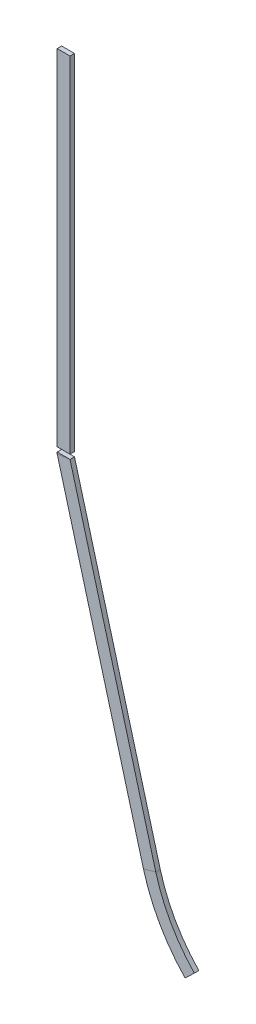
ISO-10303-21;
HEADER;
FILE_DESCRIPTION(('STEP AP214'),'2;1');
FILE_NAME('part.step','',(''),(''),'','','');
FILE_SCHEMA(('AUTOMOTIVE_DESIGN { 1 0 10303 214 1 1 1 1 }'));
ENDSEC;
DATA;
#1=APPLICATION_CONTEXT('core data for automotive mechanical design processes');
#2=APPLICATION_PROTOCOL_DEFINITION('international standard','automotive_design',2000,#1);
#3=PRODUCT_CONTEXT('',#1,'mechanical');
#4=PRODUCT('Part','Part','',(#3));
#5=PRODUCT_RELATED_PRODUCT_CATEGORY('part','',(#4));
#6=PRODUCT_DEFINITION_FORMATION('','',#4);
#7=PRODUCT_DEFINITION_CONTEXT('part definition',#1,'design');
#8=PRODUCT_DEFINITION('design','',#6,#7);
#9=PRODUCT_DEFINITION_SHAPE('','',#8);
#10=(LENGTH_UNIT() NAMED_UNIT(*) SI_UNIT(.MILLI.,.METRE.));
#11=(NAMED_UNIT(*) PLANE_ANGLE_UNIT() SI_UNIT($,.RADIAN.));
#12=(NAMED_UNIT(*) SI_UNIT($,.STERADIAN.) SOLID_ANGLE_UNIT());
#13=UNCERTAINTY_MEASURE_WITH_UNIT(LENGTH_MEASURE(1.E-05),#10,'distance_accuracy_value','');
#14=(GEOMETRIC_REPRESENTATION_CONTEXT(3) GLOBAL_UNCERTAINTY_ASSIGNED_CONTEXT((#13)) GLOBAL_UNIT_ASSIGNED_CONTEXT((#10,
#11,#12)) REPRESENTATION_CONTEXT('',''));
#15=CARTESIAN_POINT('',(0.,0.,0.));
#16=DIRECTION('',(0.,0.,1.));
#17=DIRECTION('',(1.,0.,0.));
#18=AXIS2_PLACEMENT_3D('',#15,#16,#17);
#19=CARTESIAN_POINT('',(-587.500000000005,2533.,-7.));
#20=DIRECTION('',(0.,0.,-1.));
#21=DIRECTION('',(-1.,0.,0.));
#22=AXIS2_PLACEMENT_3D('',#19,#20,#21);
#23=PLANE('',#22);
#24=DIRECTION('',(0.,-1.,0.));
#25=VECTOR('',#24,1.);
#26=CARTESIAN_POINT('',(-627.500000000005,2532.99999999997,-7.));
#27=LINE('',#26,#25);
#28=CARTESIAN_POINT('',(-627.500000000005,1443.,-7.));
#29=VERTEX_POINT('',#28);
#30=CARTESIAN_POINT('',(-627.500000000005,1437.64199433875,-7.));
#31=VERTEX_POINT('',#30);
#32=EDGE_CURVE('E111',#29,#31,#27,.T.);
#33=ORIENTED_EDGE('',*,*,#32,.F.);
#34=DIRECTION('',(-1.,0.,0.));
#35=VECTOR('',#34,1.);
#36=CARTESIAN_POINT('',(-587.500000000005,1443.,-7.));
#37=LINE('',#36,#35);
#38=CARTESIAN_POINT('',(-587.500000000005,1443.,-7.));
#39=VERTEX_POINT('',#38);
#40=EDGE_CURVE('E70',#39,#29,#37,.T.);
#41=ORIENTED_EDGE('',*,*,#40,.F.);
#42=DIRECTION('',(-0.991147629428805,-0.132764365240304,0.));
#43=VECTOR('',#42,1.);
#44=CARTESIAN_POINT('',(-444.067896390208,1462.21275057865,-6.99999999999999));
#45=LINE('',#44,#43);
#46=EDGE_CURVE('E117',#39,#31,#45,.T.);
#47=ORIENTED_EDGE('',*,*,#46,.T.);
#48=EDGE_LOOP('',(#33,#41,#47));
#49=FACE_BOUND('',#48,.T.);
#50=ADVANCED_FACE('F43',(#49),#23,.T.);
#51=CARTESIAN_POINT('',(-627.500000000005,2532.99999999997,-7.));
#52=DIRECTION('',(-1.,0.,0.));
#53=DIRECTION('',(0.,-1.,0.));
#54=AXIS2_PLACEMENT_3D('',#51,#52,#53);
#55=PLANE('',#54);
#56=DIRECTION('',(0.,-1.,0.));
#57=VECTOR('',#56,1.);
#58=CARTESIAN_POINT('',(-627.500000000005,2532.99999999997,7.));
#59=LINE('',#58,#57);
#60=CARTESIAN_POINT('',(-627.500000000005,1443.,7.));
#61=VERTEX_POINT('',#60);
#62=CARTESIAN_POINT('',(-627.500000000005,1437.64199433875,7.));
#63=VERTEX_POINT('',#62);
#64=EDGE_CURVE('E46',#61,#63,#59,.T.);
#65=ORIENTED_EDGE('',*,*,#64,.F.);
#66=DIRECTION('',(0.,0.,1.));
#67=VECTOR('',#66,1.);
#68=CARTESIAN_POINT('',(-627.500000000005,1443.,-49.3792402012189));
#69=LINE('',#68,#67);
#70=EDGE_CURVE('E51',#29,#61,#69,.T.);
#71=ORIENTED_EDGE('',*,*,#70,.F.);
#72=ORIENTED_EDGE('',*,*,#32,.T.);
#73=DIRECTION('',(0.,0.,1.));
#74=VECTOR('',#73,1.);
#75=CARTESIAN_POINT('',(-627.500000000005,1437.64199433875,-7.));
#76=LINE('',#75,#74);
#77=EDGE_CURVE('E114',#31,#63,#76,.T.);
#78=ORIENTED_EDGE('',*,*,#77,.T.);
#79=EDGE_LOOP('',(#65,#71,#72,#78));
#80=FACE_BOUND('',#79,.T.);
#81=ADVANCED_FACE('F113',(#80),#55,.T.);
#82=CARTESIAN_POINT('',(-587.500000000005,2533.,7.));
#83=DIRECTION('',(0.,0.,1.));
#84=DIRECTION('',(1.,0.,0.));
#85=AXIS2_PLACEMENT_3D('',#82,#83,#84);
#86=PLANE('',#85);
#87=DIRECTION('',(0.991147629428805,0.132764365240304,0.));
#88=VECTOR('',#87,1.);
#89=CARTESIAN_POINT('',(-444.067896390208,1462.21275057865,7.));
#90=LINE('',#89,#88);
#91=CARTESIAN_POINT('',(-587.500000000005,1443.,7.));
#92=VERTEX_POINT('',#91);
#93=EDGE_CURVE('E126',#63,#92,#90,.T.);
#94=ORIENTED_EDGE('',*,*,#93,.T.);
#95=DIRECTION('',(-1.,0.,0.));
#96=VECTOR('',#95,1.);
#97=CARTESIAN_POINT('',(-587.500000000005,1443.,7.));
#98=LINE('',#97,#96);
#99=EDGE_CURVE('E63',#92,#61,#98,.T.);
#100=ORIENTED_EDGE('',*,*,#99,.T.);
#101=ORIENTED_EDGE('',*,*,#64,.T.);
#102=EDGE_LOOP('',(#94,#100,#101));
#103=FACE_BOUND('',#102,.T.);
#104=ADVANCED_FACE('F189',(#103),#86,.T.);
#105=CARTESIAN_POINT('',(225.88270358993,653.858954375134,0.));
#106=DIRECTION('',(0.689407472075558,-0.724373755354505,0.));
#107=DIRECTION('',(0.724373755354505,0.689407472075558,0.));
#108=AXIS2_PLACEMENT_3D('',#105,#106,#107);
#109=PLANE('',#108);
#110=DIRECTION('',(0.,0.,-1.));
#111=VECTOR('',#110,1.);
#112=CARTESIAN_POINT('',(-228.66182789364,221.255765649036,-7.));
#113=LINE('',#112,#111);
#114=CARTESIAN_POINT('',(-228.66182789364,221.255765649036,7.));
#115=VERTEX_POINT('',#114);
#116=CARTESIAN_POINT('',(-228.66182789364,221.255765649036,-7.));
#117=VERTEX_POINT('',#116);
#118=EDGE_CURVE('E140',#115,#117,#113,.T.);
#119=ORIENTED_EDGE('',*,*,#118,.T.);
#120=DIRECTION('',(0.724373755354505,0.689407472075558,0.));
#121=VECTOR('',#120,1.);
#122=CARTESIAN_POINT('',(-199.68687767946,248.832064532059,-7.));
#123=LINE('',#122,#121);
#124=CARTESIAN_POINT('',(-199.68687767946,248.832064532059,-7.));
#125=VERTEX_POINT('',#124);
#126=EDGE_CURVE('E141',#117,#125,#123,.T.);
#127=ORIENTED_EDGE('',*,*,#126,.T.);
#128=DIRECTION('',(0.,0.,1.));
#129=VECTOR('',#128,1.);
#130=CARTESIAN_POINT('',(-199.68687767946,248.832064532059,-7.));
#131=LINE('',#130,#129);
#132=CARTESIAN_POINT('',(-199.68687767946,248.832064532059,7.));
#133=VERTEX_POINT('',#132);
#134=EDGE_CURVE('E146',#125,#133,#131,.T.);
#135=ORIENTED_EDGE('',*,*,#134,.T.);
#136=DIRECTION('',(-0.724373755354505,-0.689407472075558,0.));
#137=VECTOR('',#136,1.);
#138=CARTESIAN_POINT('',(-199.68687767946,248.832064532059,7.));
#139=LINE('',#138,#137);
#140=EDGE_CURVE('E179',#133,#115,#139,.T.);
#141=ORIENTED_EDGE('',*,*,#140,.T.);
#142=EDGE_LOOP('',(#119,#127,#135,#141));
#143=FACE_BOUND('',#142,.T.);
#144=ADVANCED_FACE('F191',(#143),#109,.T.);
#145=CARTESIAN_POINT('',(-589.006933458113,1448.52405199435,-7.));
#146=DIRECTION('',(0.964747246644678,0.263178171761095,0.));
#147=DIRECTION('',(-0.263178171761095,0.964747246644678,0.));
#148=AXIS2_PLACEMENT_3D('',#145,#146,#147);
#149=PLANE('',#148);
#150=DIRECTION('',(0.,0.,-1.));
#151=VECTOR('',#150,1.);
#152=CARTESIAN_POINT('',(-587.500000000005,1443.,-7.));
#153=LINE('',#152,#151);
#154=EDGE_CURVE('E12',#92,#39,#153,.T.);
#155=ORIENTED_EDGE('',*,*,#154,.F.);
#156=DIRECTION('',(0.263178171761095,-0.964747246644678,0.));
#157=VECTOR('',#156,1.);
#158=CARTESIAN_POINT('',(-589.006933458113,1448.52405199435,7.));
#159=LINE('',#158,#157);
#160=CARTESIAN_POINT('',(-319.873623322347,461.946714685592,7.));
#161=VERTEX_POINT('',#160);
#162=EDGE_CURVE('E180',#92,#161,#159,.T.);
#163=ORIENTED_EDGE('',*,*,#162,.T.);
#164=DIRECTION('',(0.,0.,1.));
#165=VECTOR('',#164,1.);
#166=CARTESIAN_POINT('',(-319.873623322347,461.946714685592,-7.));
#167=LINE('',#166,#165);
#168=CARTESIAN_POINT('',(-319.873623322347,461.946714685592,-7.));
#169=VERTEX_POINT('',#168);
#170=EDGE_CURVE('E176',#169,#161,#167,.T.);
#171=ORIENTED_EDGE('',*,*,#170,.F.);
#172=DIRECTION('',(0.263178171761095,-0.964747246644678,0.));
#173=VECTOR('',#172,1.);
#174=CARTESIAN_POINT('',(-589.006933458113,1448.52405199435,-7.));
#175=LINE('',#174,#173);
#176=EDGE_CURVE('E79',#39,#169,#175,.T.);
#177=ORIENTED_EDGE('',*,*,#176,.F.);
#178=EDGE_LOOP('',(#155,#163,#171,#177));
#179=FACE_BOUND('',#178,.T.);
#180=ADVANCED_FACE('F198',(#179),#149,.T.);
#181=CARTESIAN_POINT('',(-589.006933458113,1448.52405199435,7.));
#182=DIRECTION('',(0.,0.,1.));
#183=DIRECTION('',(1.,0.,0.));
#184=AXIS2_PLACEMENT_3D('',#181,#182,#183);
#185=PLANE('',#184);
#186=ORIENTED_EDGE('',*,*,#93,.F.);
#187=DIRECTION('',(0.263178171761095,-0.964747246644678,0.));
#188=VECTOR('',#187,1.);
#189=CARTESIAN_POINT('',(-627.596823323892,1437.99692512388,7.));
#190=LINE('',#189,#188);
#191=CARTESIAN_POINT('',(-358.463513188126,451.419587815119,7.));
#192=VERTEX_POINT('',#191);
#193=EDGE_CURVE('E125',#63,#192,#190,.T.);
#194=ORIENTED_EDGE('',*,*,#193,.T.);
#195=DIRECTION('',(-0.964747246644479,-0.263178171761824,0.));
#196=VECTOR('',#195,1.);
#197=CARTESIAN_POINT('',(-319.873623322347,461.946714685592,7.));
#198=LINE('',#197,#196);
#199=EDGE_CURVE('E154',#161,#192,#198,.T.);
#200=ORIENTED_EDGE('',*,*,#199,.F.);
#201=ORIENTED_EDGE('',*,*,#162,.F.);
#202=EDGE_LOOP('',(#186,#194,#200,#201));
#203=FACE_BOUND('',#202,.T.);
#204=ADVANCED_FACE('F188',(#203),#185,.T.);
#205=CARTESIAN_POINT('',(-627.596823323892,1437.99692512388,-7.));
#206=DIRECTION('',(-0.964747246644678,-0.263178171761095,0.));
#207=DIRECTION('',(0.263178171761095,-0.964747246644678,0.));
#208=AXIS2_PLACEMENT_3D('',#205,#206,#207);
#209=PLANE('',#208);
#210=ORIENTED_EDGE('',*,*,#77,.F.);
#211=DIRECTION('',(0.263178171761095,-0.964747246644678,0.));
#212=VECTOR('',#211,1.);
#213=CARTESIAN_POINT('',(-627.596823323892,1437.99692512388,-7.));
#214=LINE('',#213,#212);
#215=CARTESIAN_POINT('',(-358.463513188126,451.419587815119,-7.));
#216=VERTEX_POINT('',#215);
#217=EDGE_CURVE('E123',#31,#216,#214,.T.);
#218=ORIENTED_EDGE('',*,*,#217,.T.);
#219=DIRECTION('',(0.,0.,-1.));
#220=VECTOR('',#219,1.);
#221=CARTESIAN_POINT('',(-358.463513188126,451.419587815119,-7.));
#222=LINE('',#221,#220);
#223=EDGE_CURVE('E149',#192,#216,#222,.T.);
#224=ORIENTED_EDGE('',*,*,#223,.F.);
#225=ORIENTED_EDGE('',*,*,#193,.F.);
#226=EDGE_LOOP('',(#210,#218,#224,#225));
#227=FACE_BOUND('',#226,.T.);
#228=ADVANCED_FACE('F121',(#227),#209,.T.);
#229=CARTESIAN_POINT('',(-589.006933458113,1448.52405199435,-7.));
#230=DIRECTION('',(0.,0.,-1.));
#231=DIRECTION('',(-1.,0.,0.));
#232=AXIS2_PLACEMENT_3D('',#229,#230,#231);
#233=PLANE('',#232);
#234=ORIENTED_EDGE('',*,*,#46,.F.);
#235=ORIENTED_EDGE('',*,*,#176,.T.);
#236=DIRECTION('',(0.964747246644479,0.263178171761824,0.));
#237=VECTOR('',#236,1.);
#238=CARTESIAN_POINT('',(-319.873623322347,461.946714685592,-7.));
#239=LINE('',#238,#237);
#240=EDGE_CURVE('E130',#216,#169,#239,.T.);
#241=ORIENTED_EDGE('',*,*,#240,.F.);
#242=ORIENTED_EDGE('',*,*,#217,.F.);
#243=EDGE_LOOP('',(#234,#235,#241,#242));
#244=FACE_BOUND('',#243,.T.);
#245=ADVANCED_FACE('F128',(#244),#233,.T.);
#246=CARTESIAN_POINT('',(162.499999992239,593.53580056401,0.));
#247=DIRECTION('',(0.,0.,1.));
#248=DIRECTION('',(1.,0.,0.));
#249=AXIS2_PLACEMENT_3D('',#246,#247,#248);
#250=CYLINDRICAL_SURFACE('',#249,499.999999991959);
#251=CARTESIAN_POINT('',(162.499999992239,593.53580056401,7.));
#252=DIRECTION('',(0.,0.,1.));
#253=DIRECTION('',(-0.964747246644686,-0.263178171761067,0.));
#254=AXIS2_PLACEMENT_3D('',#251,#252,#253);
#255=CIRCLE('',#254,499.999999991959);
#256=EDGE_CURVE('E171',#161,#133,#255,.T.);
#257=ORIENTED_EDGE('',*,*,#256,.T.);
#258=ORIENTED_EDGE('',*,*,#134,.F.);
#259=CARTESIAN_POINT('',(162.499999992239,593.53580056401,-7.));
#260=DIRECTION('',(0.,0.,1.));
#261=DIRECTION('',(-0.964747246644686,-0.263178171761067,0.));
#262=AXIS2_PLACEMENT_3D('',#259,#260,#261);
#263=CIRCLE('',#262,499.999999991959);
#264=EDGE_CURVE('E139',#169,#125,#263,.T.);
#265=ORIENTED_EDGE('',*,*,#264,.F.);
#266=ORIENTED_EDGE('',*,*,#170,.T.);
#267=EDGE_LOOP('',(#257,#258,#265,#266));
#268=FACE_BOUND('',#267,.T.);
#269=ADVANCED_FACE('F255',(#268),#250,.F.);
#270=CARTESIAN_POINT('',(-319.873623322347,461.946714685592,7.));
#271=DIRECTION('',(0.,0.,1.));
#272=DIRECTION('',(1.,0.,0.));
#273=AXIS2_PLACEMENT_3D('',#270,#271,#272);
#274=PLANE('',#273);
#275=CARTESIAN_POINT('',(162.499999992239,593.53580056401,7.));
#276=DIRECTION('',(0.,0.,1.));
#277=DIRECTION('',(-0.964747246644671,-0.263178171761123,0.));
#278=AXIS2_PLACEMENT_3D('',#275,#276,#277);
#279=CIRCLE('',#278,539.999999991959);
#280=EDGE_CURVE('E163',#192,#115,#279,.T.);
#281=ORIENTED_EDGE('',*,*,#280,.T.);
#282=ORIENTED_EDGE('',*,*,#140,.F.);
#283=ORIENTED_EDGE('',*,*,#256,.F.);
#284=ORIENTED_EDGE('',*,*,#199,.T.);
#285=EDGE_LOOP('',(#281,#282,#283,#284));
#286=FACE_BOUND('',#285,.T.);
#287=ADVANCED_FACE('F168',(#286),#274,.T.);
#288=CARTESIAN_POINT('',(162.499999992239,593.53580056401,0.));
#289=DIRECTION('',(0.,0.,1.));
#290=DIRECTION('',(1.,0.,0.));
#291=AXIS2_PLACEMENT_3D('',#288,#289,#290);
#292=CYLINDRICAL_SURFACE('',#291,539.999999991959);
#293=CARTESIAN_POINT('',(162.499999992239,593.53580056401,-7.));
#294=DIRECTION('',(0.,0.,1.));
#295=DIRECTION('',(-0.964747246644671,-0.263178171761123,0.));
#296=AXIS2_PLACEMENT_3D('',#293,#294,#295);
#297=CIRCLE('',#296,539.999999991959);
#298=EDGE_CURVE('E151',#216,#117,#297,.T.);
#299=ORIENTED_EDGE('',*,*,#298,.T.);
#300=ORIENTED_EDGE('',*,*,#118,.F.);
#301=ORIENTED_EDGE('',*,*,#280,.F.);
#302=ORIENTED_EDGE('',*,*,#223,.T.);
#303=EDGE_LOOP('',(#299,#300,#301,#302));
#304=FACE_BOUND('',#303,.T.);
#305=ADVANCED_FACE('F161',(#304),#292,.T.);
#306=CARTESIAN_POINT('',(-319.873623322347,461.946714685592,-7.));
#307=DIRECTION('',(0.,0.,-1.));
#308=DIRECTION('',(-1.,0.,0.));
#309=AXIS2_PLACEMENT_3D('',#306,#307,#308);
#310=PLANE('',#309);
#311=ORIENTED_EDGE('',*,*,#126,.F.);
#312=ORIENTED_EDGE('',*,*,#298,.F.);
#313=ORIENTED_EDGE('',*,*,#240,.T.);
#314=ORIENTED_EDGE('',*,*,#264,.T.);
#315=EDGE_LOOP('',(#311,#312,#313,#314));
#316=FACE_BOUND('',#315,.T.);
#317=ADVANCED_FACE('F193',(#316),#310,.T.);
#318=CARTESIAN_POINT('',(-587.500000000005,1443.,-49.3792402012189));
#319=DIRECTION('',(0.,1.,0.));
#320=DIRECTION('',(-1.,0.,0.));
#321=AXIS2_PLACEMENT_3D('',#318,#319,#320);
#322=PLANE('',#321);
#323=ORIENTED_EDGE('',*,*,#40,.T.);
#324=ORIENTED_EDGE('',*,*,#70,.T.);
#325=ORIENTED_EDGE('',*,*,#99,.F.);
#326=ORIENTED_EDGE('',*,*,#154,.T.);
#327=EDGE_LOOP('',(#323,#324,#325,#326));
#328=FACE_BOUND('',#327,.T.);
#329=ADVANCED_FACE('F200',(#328),#322,.T.);
#330=CLOSED_SHELL('',(#50,#81,#104,#144,#180,#204,#228,#245,#269,#287,#305,#317,#329));
#331=MANIFOLD_SOLID_BREP('B2',#330);
#332=CARTESIAN_POINT('',(-1.91229254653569E-09,2533.00000000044,0.));
#333=DIRECTION('',(7.54951656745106E-13,-1.,0.));
#334=DIRECTION('',(1.,7.54951656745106E-13,0.));
#335=AXIS2_PLACEMENT_3D('',#332,#333,#334);
#336=PLANE('',#335);
#337=DIRECTION('',(0.,0.,-1.));
#338=VECTOR('',#337,1.);
#339=CARTESIAN_POINT('',(-627.500000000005,2532.99999999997,-7.));
#340=LINE('',#339,#338);
#341=CARTESIAN_POINT('',(-627.500000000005,2532.99999999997,7.));
#342=VERTEX_POINT('',#341);
#343=CARTESIAN_POINT('',(-627.500000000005,2532.99999999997,-7.));
#344=VERTEX_POINT('',#343);
#345=EDGE_CURVE('E357',#342,#344,#340,.T.);
#346=ORIENTED_EDGE('',*,*,#345,.F.);
#347=DIRECTION('',(-1.,-7.54951656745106E-13,0.));
#348=VECTOR('',#347,1.);
#349=CARTESIAN_POINT('',(-587.500000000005,2533.,7.));
#350=LINE('',#349,#348);
#351=CARTESIAN_POINT('',(-587.500000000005,2533.,7.));
#352=VERTEX_POINT('',#351);
#353=EDGE_CURVE('E359',#352,#342,#350,.T.);
#354=ORIENTED_EDGE('',*,*,#353,.F.);
#355=DIRECTION('',(0.,0.,1.));
#356=VECTOR('',#355,1.);
#357=CARTESIAN_POINT('',(-587.500000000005,2533.,-7.));
#358=LINE('',#357,#356);
#359=CARTESIAN_POINT('',(-587.500000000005,2533.,-7.));
#360=VERTEX_POINT('',#359);
#361=EDGE_CURVE('E354',#360,#352,#358,.T.);
#362=ORIENTED_EDGE('',*,*,#361,.F.);
#363=DIRECTION('',(1.,7.54951656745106E-13,0.));
#364=VECTOR('',#363,1.);
#365=CARTESIAN_POINT('',(-587.500000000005,2533.,-7.));
#366=LINE('',#365,#364);
#367=EDGE_CURVE('E304',#344,#360,#366,.T.);
#368=ORIENTED_EDGE('',*,*,#367,.F.);
#369=EDGE_LOOP('',(#346,#354,#362,#368));
#370=FACE_BOUND('',#369,.T.);
#371=ADVANCED_FACE('F301',(#370),#336,.F.);
#372=CARTESIAN_POINT('',(-587.500000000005,2533.,-7.));
#373=DIRECTION('',(1.,0.,0.));
#374=DIRECTION('',(0.,1.,0.));
#375=AXIS2_PLACEMENT_3D('',#372,#373,#374);
#376=PLANE('',#375);
#377=DIRECTION('',(0.,-1.,0.));
#378=VECTOR('',#377,1.);
#379=CARTESIAN_POINT('',(-587.500000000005,2533.,7.));
#380=LINE('',#379,#378);
#381=CARTESIAN_POINT('',(-587.500000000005,1457.00000000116,7.));
#382=VERTEX_POINT('',#381);
#383=EDGE_CURVE('E363',#352,#382,#380,.T.);
#384=ORIENTED_EDGE('',*,*,#383,.T.);
#385=DIRECTION('',(0.,0.,1.));
#386=VECTOR('',#385,1.);
#387=CARTESIAN_POINT('',(-587.500000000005,1457.00000000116,-49.3792402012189));
#388=LINE('',#387,#386);
#389=CARTESIAN_POINT('',(-587.500000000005,1457.00000000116,-7.));
#390=VERTEX_POINT('',#389);
#391=EDGE_CURVE('E346',#390,#382,#388,.T.);
#392=ORIENTED_EDGE('',*,*,#391,.F.);
#393=DIRECTION('',(0.,-1.,0.));
#394=VECTOR('',#393,1.);
#395=CARTESIAN_POINT('',(-587.500000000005,2533.,-7.));
#396=LINE('',#395,#394);
#397=EDGE_CURVE('E353',#360,#390,#396,.T.);
#398=ORIENTED_EDGE('',*,*,#397,.F.);
#399=ORIENTED_EDGE('',*,*,#361,.T.);
#400=EDGE_LOOP('',(#384,#392,#398,#399));
#401=FACE_BOUND('',#400,.T.);
#402=ADVANCED_FACE('F375',(#401),#376,.T.);
#403=CARTESIAN_POINT('',(-587.500000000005,2533.,7.));
#404=DIRECTION('',(0.,0.,1.));
#405=DIRECTION('',(1.,0.,0.));
#406=AXIS2_PLACEMENT_3D('',#403,#404,#405);
#407=PLANE('',#406);
#408=DIRECTION('',(0.,-1.,0.));
#409=VECTOR('',#408,1.);
#410=CARTESIAN_POINT('',(-627.500000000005,2532.99999999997,7.));
#411=LINE('',#410,#409);
#412=CARTESIAN_POINT('',(-627.500000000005,1457.00000000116,7.));
#413=VERTEX_POINT('',#412);
#414=EDGE_CURVE('E309',#342,#413,#411,.T.);
#415=ORIENTED_EDGE('',*,*,#414,.T.);
#416=DIRECTION('',(1.,0.,0.));
#417=VECTOR('',#416,1.);
#418=CARTESIAN_POINT('',(-627.500000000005,1457.00000000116,7.));
#419=LINE('',#418,#417);
#420=EDGE_CURVE('E342',#413,#382,#419,.T.);
#421=ORIENTED_EDGE('',*,*,#420,.T.);
#422=ORIENTED_EDGE('',*,*,#383,.F.);
#423=ORIENTED_EDGE('',*,*,#353,.T.);
#424=EDGE_LOOP('',(#415,#421,#422,#423));
#425=FACE_BOUND('',#424,.T.);
#426=ADVANCED_FACE('F373',(#425),#407,.T.);
#427=CARTESIAN_POINT('',(-627.500000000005,2532.99999999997,-7.));
#428=DIRECTION('',(-1.,0.,0.));
#429=DIRECTION('',(0.,-1.,0.));
#430=AXIS2_PLACEMENT_3D('',#427,#428,#429);
#431=PLANE('',#430);
#432=DIRECTION('',(0.,-1.,0.));
#433=VECTOR('',#432,1.);
#434=CARTESIAN_POINT('',(-627.500000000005,2532.99999999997,-7.));
#435=LINE('',#434,#433);
#436=CARTESIAN_POINT('',(-627.500000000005,1457.00000000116,-7.));
#437=VERTEX_POINT('',#436);
#438=EDGE_CURVE('E41',#344,#437,#435,.T.);
#439=ORIENTED_EDGE('',*,*,#438,.T.);
#440=DIRECTION('',(0.,0.,1.));
#441=VECTOR('',#440,1.);
#442=CARTESIAN_POINT('',(-627.500000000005,1457.00000000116,-49.3792402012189));
#443=LINE('',#442,#441);
#444=EDGE_CURVE('E339',#437,#413,#443,.T.);
#445=ORIENTED_EDGE('',*,*,#444,.T.);
#446=ORIENTED_EDGE('',*,*,#414,.F.);
#447=ORIENTED_EDGE('',*,*,#345,.T.);
#448=EDGE_LOOP('',(#439,#445,#446,#447));
#449=FACE_BOUND('',#448,.T.);
#450=ADVANCED_FACE('F356',(#449),#431,.T.);
#451=CARTESIAN_POINT('',(-587.500000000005,2533.,-7.));
#452=DIRECTION('',(0.,0.,-1.));
#453=DIRECTION('',(-1.,0.,0.));
#454=AXIS2_PLACEMENT_3D('',#451,#452,#453);
#455=PLANE('',#454);
#456=ORIENTED_EDGE('',*,*,#397,.T.);
#457=DIRECTION('',(1.,0.,0.));
#458=VECTOR('',#457,1.);
#459=CARTESIAN_POINT('',(-627.500000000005,1457.00000000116,-7.));
#460=LINE('',#459,#458);
#461=EDGE_CURVE('E316',#437,#390,#460,.T.);
#462=ORIENTED_EDGE('',*,*,#461,.F.);
#463=ORIENTED_EDGE('',*,*,#438,.F.);
#464=ORIENTED_EDGE('',*,*,#367,.T.);
#465=EDGE_LOOP('',(#456,#462,#463,#464));
#466=FACE_BOUND('',#465,.T.);
#467=ADVANCED_FACE('F351',(#466),#455,.T.);
#468=CARTESIAN_POINT('',(-627.500000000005,1457.00000000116,-49.3792402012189));
#469=DIRECTION('',(0.,-1.,0.));
#470=DIRECTION('',(0.,0.,-1.));
#471=AXIS2_PLACEMENT_3D('',#468,#469,#470);
#472=PLANE('',#471);
#473=ORIENTED_EDGE('',*,*,#461,.T.);
#474=ORIENTED_EDGE('',*,*,#391,.T.);
#475=ORIENTED_EDGE('',*,*,#420,.F.);
#476=ORIENTED_EDGE('',*,*,#444,.F.);
#477=EDGE_LOOP('',(#473,#474,#475,#476));
#478=FACE_BOUND('',#477,.T.);
#479=ADVANCED_FACE('F340',(#478),#472,.T.);
#480=CLOSED_SHELL('',(#371,#402,#426,#450,#467,#479));
#481=MANIFOLD_SOLID_BREP('B6',#480);
#482=ADVANCED_BREP_SHAPE_REPRESENTATION('',(#18,#331,#481),#14);
#483=SHAPE_DEFINITION_REPRESENTATION(#9,#482);
ENDSEC;
END-ISO-10303-21;
